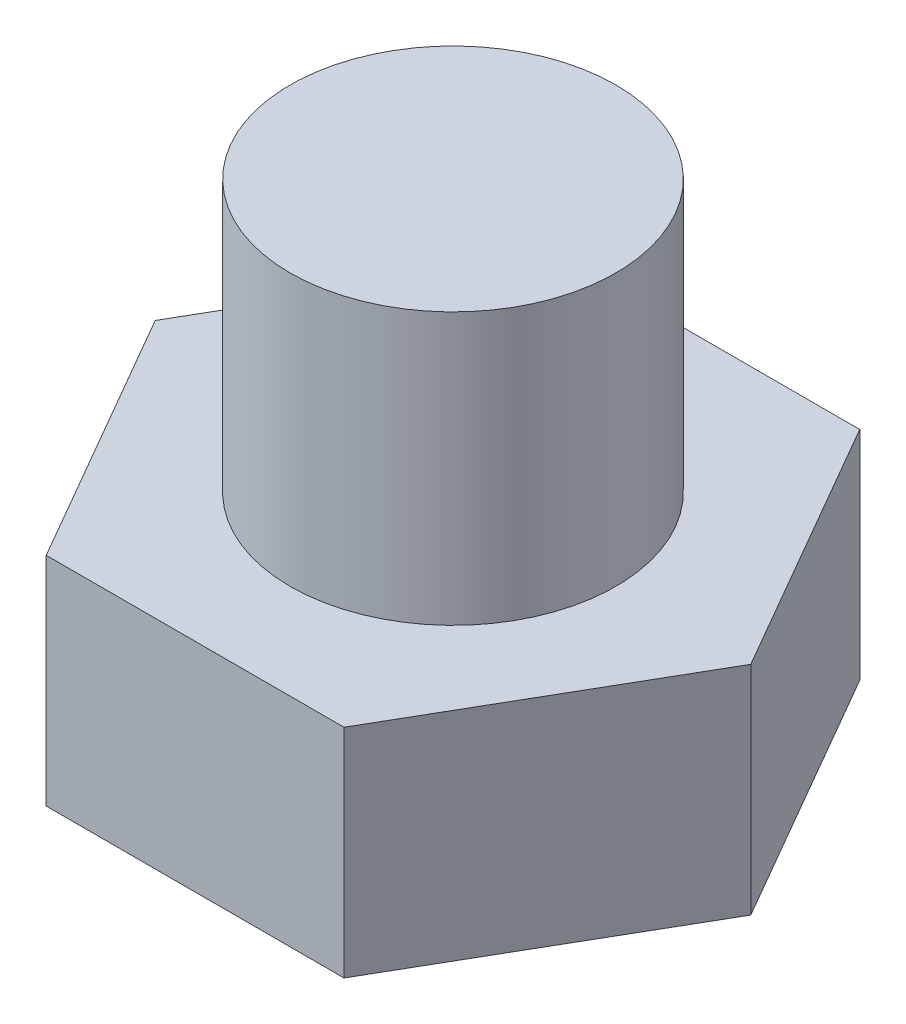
from build123d import *

# Parameters (mm, degrees)
BOSS_EXTRUDE1_DEPTH = 8
SKETCH2_R           = 6
BOSS_EXTRUDE2_DEPTH = 10


with BuildPart() as part:
    # Sketch1 → Boss-Extrude1 (new body)
    with BuildSketch(Plane(origin=(0, 0, 0), x_dir=(1, 0, 0), z_dir=(0, 1, 0))):
        Polygon((5.484827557, 9.5), (-5.484827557, 9.5), (-10.969655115, 0), (-5.484827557, -9.5), (5.484827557, -9.5), (10.969655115, 0), align=None)
    extrude(amount=BOSS_EXTRUDE1_DEPTH)

    # Sketch2 → Boss-Extrude2 (add)
    with BuildSketch(Plane(origin=(0, 8, 0), x_dir=(1, 0, 0), z_dir=(0, 1, 0))):
        with Locations(Location((0, 0, 0), (0, 0, 270))):
            Circle(SKETCH2_R)
    extrude(amount=BOSS_EXTRUDE2_DEPTH)


solid = part.part
